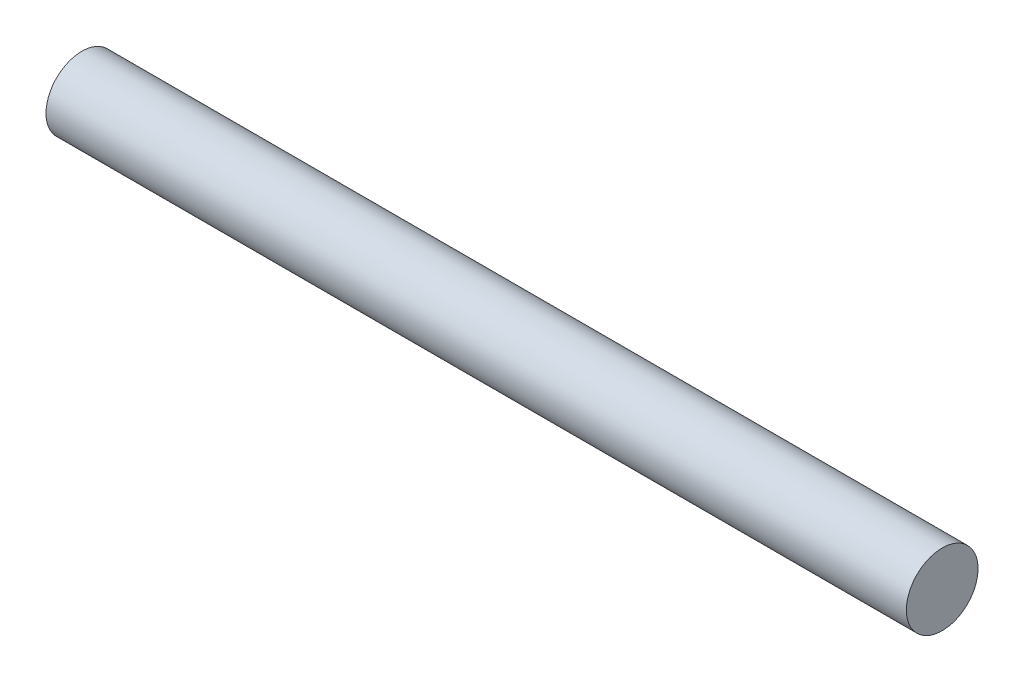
from build123d import *

# Parameters (mm, degrees)
SKETCH1_R           = 3.175
BOSS_EXTRUDE1_DEPTH = 38.1


with BuildPart() as part:
    # Sketch1 → Boss-Extrude1 (new, symmetric)
    with BuildSketch(Plane(origin=(0, 0, 0), x_dir=(0, 0, -1), z_dir=(1, 0, 0))):
        with Locations(Location((0, 0, 0), (0, 0, 180))):
            Circle(SKETCH1_R)
    extrude(amount=BOSS_EXTRUDE1_DEPTH, both=True)


solid = part.part
